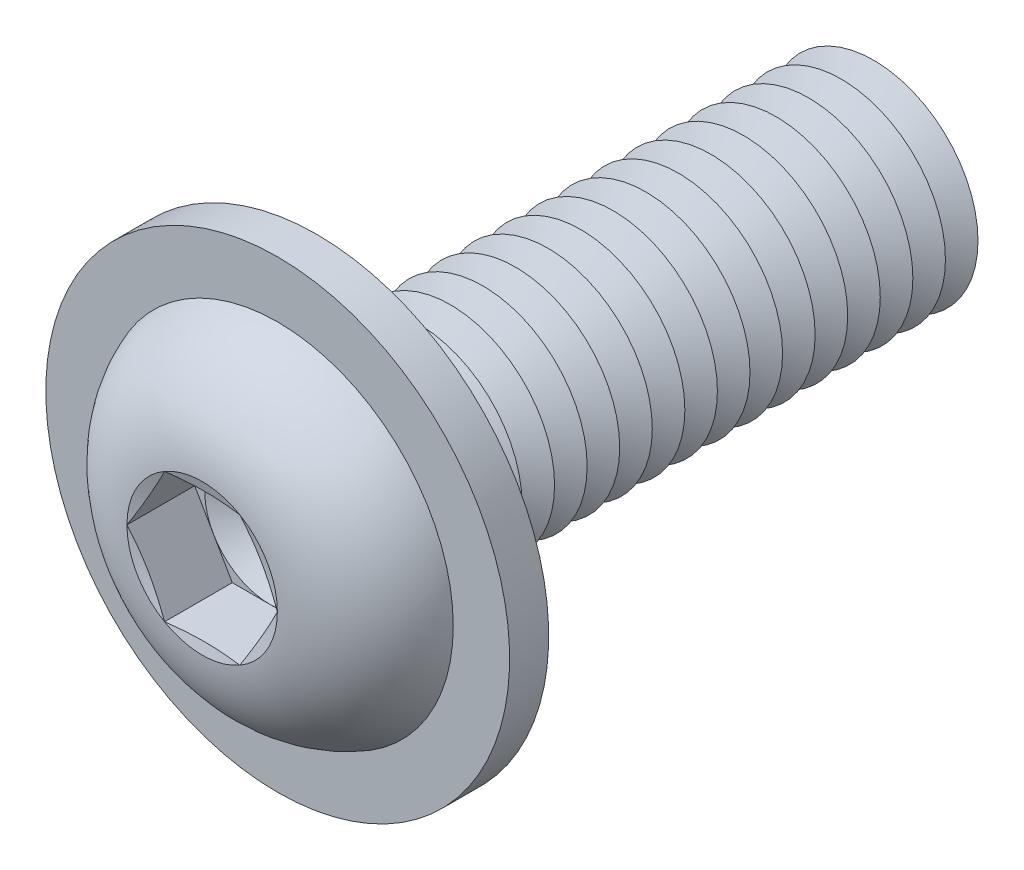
from build123d import *

# Parameters (mm, degrees)
FILLET1_R           = 0.625
LPATTERN1_COUNT     = 17
LPATTERN1_PITCH     = 1.25
CUT_EXTRUDE1_DEPTH  = 2.6
SKETCH5_R           = 8.9
SKETCH5_R_2         = 4.625
BOSS_EXTRUDE1_DEPTH = 1.5


with BuildPart() as part:
    # Sketch1 → Revolve1 (revolve)
    with BuildSketch(Plane(origin=(0, 0, 0), x_dir=(0, 0, -1), z_dir=(1, 0, 0)), mode=Mode.PRIVATE) as revolve1_sk:
        with BuildLine():
            Line((0, 4), (0, 7))
            ThreePointArc((0, 7), (-3.011595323, 5.81154966), (-4.4, 2.88675))
            Line((-4.4, 2.88675), (-4.013248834, 1.443375))
            Line((-4.013248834, 1.443375), (-4.4, 1.443375))
            Line((-4.4, 1.443375), (-4.4, 0))
            Line((-4.4, 0), (22, 0))
            Line((22, 0), (22, 4))
            Line((22, 4), (0, 4))
        make_face()
    revolve(revolve1_sk.sketch.rotate(Axis((0, 0, -22), (0, 0, 1)), 90), axis=Axis((0, 0, -22), (0, 0, 1)))

    # Fillet1
    fillet1_edges = [part.edges().sort_by_distance(p)[0] for p in [
        (4, 0, 0),
    ]]
    fillet(fillet1_edges, radius=FILLET1_R)

    # Sketch2 → Cut-Revolve1 (revolve, cut)
    with BuildSketch(Plane(origin=(0, 0, 0), x_dir=(0, 0, -1), z_dir=(1, 0, 0)), mode=Mode.PRIVATE) as cut_revolve1_sk:
        Polygon((21.375, 4), (22.625, 4), (22, 2.917468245), align=None)
    cut_revolve1 = revolve(cut_revolve1_sk.sketch.rotate(Axis((0, 0, -22), (0, 0, -1)), 270), axis=Axis((0, 0, -22), (0, 0, -1)), mode=Mode.SUBTRACT)

    # LPattern1: Cut-Revolve1 ×17
    with Locations(*[(0, 0, i * LPATTERN1_PITCH) for i in range(1, LPATTERN1_COUNT)]):
        add(cut_revolve1, mode=Mode.SUBTRACT)

    # Sketch3 → Cut-Extrude1 (cut)
    with BuildSketch(Plane.XY.offset(4.4)):
        Polygon((1.443375, 2.499998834), (-1.443375, 2.499998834), (-2.88675, 0), (-1.443375, -2.499998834), (1.443375, -2.499998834), (2.88675, 0), align=None)
    extrude(amount=-CUT_EXTRUDE1_DEPTH, mode=Mode.SUBTRACT)

    # Cut-Extrude2 cone 1 section (on through the dimple's axis) → Cut-Extrude2 (revolve, cut)
    with BuildSketch(Plane(origin=(0, 0, 1.8), x_dir=(0, -1, 0), z_dir=(1, 0, 0))):
        Polygon((0, 0), (2.499998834, 0), (0, 1.443375), align=None)
    revolve(axis=Axis((0, 0, 1.8), (0, 0, -1)), mode=Mode.SUBTRACT)

    # Sketch5 → Boss-Extrude1 (add)
    with BuildSketch(Plane(origin=(0, 0, 0), x_dir=(-1, 0, 0), z_dir=(0, 0, -1))):
        with Locations(Location((0, 0, 0), (0, 0, 90))):
            Circle(SKETCH5_R)
        Circle(SKETCH5_R_2, mode=Mode.SUBTRACT)
    extrude(amount=-BOSS_EXTRUDE1_DEPTH)


solid = part.part
